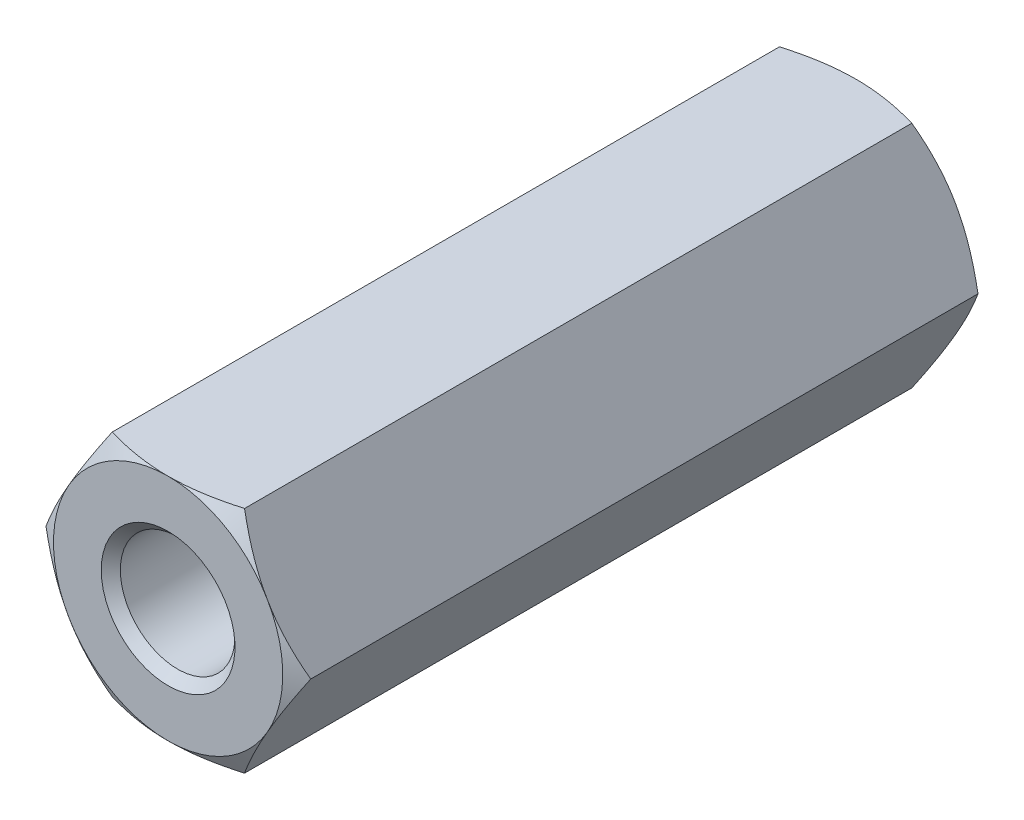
ISO-10303-21;
HEADER;
FILE_DESCRIPTION(('STEP AP214'),'2;1');
FILE_NAME('part.step','',(''),(''),'','','');
FILE_SCHEMA(('AUTOMOTIVE_DESIGN { 1 0 10303 214 1 1 1 1 }'));
ENDSEC;
DATA;
#1=APPLICATION_CONTEXT('core data for automotive mechanical design processes');
#2=APPLICATION_PROTOCOL_DEFINITION('international standard','automotive_design',2000,#1);
#3=PRODUCT_CONTEXT('',#1,'mechanical');
#4=PRODUCT('Part','Part','',(#3));
#5=PRODUCT_RELATED_PRODUCT_CATEGORY('part','',(#4));
#6=PRODUCT_DEFINITION_FORMATION('','',#4);
#7=PRODUCT_DEFINITION_CONTEXT('part definition',#1,'design');
#8=PRODUCT_DEFINITION('design','',#6,#7);
#9=PRODUCT_DEFINITION_SHAPE('','',#8);
#10=(LENGTH_UNIT() NAMED_UNIT(*) SI_UNIT(.MILLI.,.METRE.));
#11=(NAMED_UNIT(*) PLANE_ANGLE_UNIT() SI_UNIT($,.RADIAN.));
#12=(NAMED_UNIT(*) SI_UNIT($,.STERADIAN.) SOLID_ANGLE_UNIT());
#13=UNCERTAINTY_MEASURE_WITH_UNIT(LENGTH_MEASURE(1.E-05),#10,'distance_accuracy_value','');
#14=(GEOMETRIC_REPRESENTATION_CONTEXT(3) GLOBAL_UNCERTAINTY_ASSIGNED_CONTEXT((#13)) GLOBAL_UNIT_ASSIGNED_CONTEXT((#10,
#11,#12)) REPRESENTATION_CONTEXT('',''));
#15=CARTESIAN_POINT('',(0.,0.,0.));
#16=DIRECTION('',(0.,0.,1.));
#17=DIRECTION('',(1.,0.,0.));
#18=AXIS2_PLACEMENT_3D('',#15,#16,#17);
#19=CARTESIAN_POINT('',(3.46410161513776,0.,-9.));
#20=DIRECTION('',(0.866025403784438,0.5,0.));
#21=DIRECTION('',(-0.5,0.866025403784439,0.));
#22=AXIS2_PLACEMENT_3D('',#19,#20,#21);
#23=PLANE('',#22);
#24=CARTESIAN_POINT('',(3.46421708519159,-0.000199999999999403,8.73198413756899));
#25=CARTESIAN_POINT('',(3.38810199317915,0.131635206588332,8.77594629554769));
#26=CARTESIAN_POINT('',(3.31132988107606,0.26460840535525,8.81592841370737));
#27=CARTESIAN_POINT('',(3.15645624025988,0.532857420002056,8.88571791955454));
#28=CARTESIAN_POINT('',(3.078351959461,0.668138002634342,8.91550061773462));
#29=CARTESIAN_POINT('',(2.92311136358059,0.937022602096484,8.96186216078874));
#30=CARTESIAN_POINT('',(2.84599893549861,1.07058524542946,8.97874955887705));
#31=CARTESIAN_POINT('',(2.6914112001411,1.33833905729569,8.99891035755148));
#32=CARTESIAN_POINT('',(2.61393645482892,1.47252925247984,9.00220045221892));
#33=CARTESIAN_POINT('',(2.46916798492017,1.72327559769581,8.99535946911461));
#34=CARTESIAN_POINT('',(2.40185259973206,1.83986926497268,8.98690808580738));
#35=CARTESIAN_POINT('',(2.2676603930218,2.07229698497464,8.96012105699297));
#36=CARTESIAN_POINT('',(2.2007840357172,2.18813023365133,8.94177625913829));
#37=CARTESIAN_POINT('',(2.06631510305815,2.42103725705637,8.89591524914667));
#38=CARTESIAN_POINT('',(1.99873954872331,2.53808155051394,8.86820461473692));
#39=CARTESIAN_POINT('',(1.86459637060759,2.77042435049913,8.8053122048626));
#40=CARTESIAN_POINT('',(1.79802702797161,2.88572583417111,8.77014520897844));
#41=CARTESIAN_POINT('',(1.73193533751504,3.0002,8.73198413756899));
#42=B_SPLINE_CURVE_WITH_KNOTS('',3,(#24,#25,#26,#27,#28,#29,#30,#31,#32,#33,#34,#35,#36,#37,#38,
#39,#40,#41),.UNSPECIFIED.,.F.,.F.,(4,2,2,2,2,2,2,2,4),(0.,0.475539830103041,0.952222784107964,
1.41710776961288,1.88142182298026,2.28572436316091,2.69040156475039,3.10405572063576,
3.51689749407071),.UNSPECIFIED.);
#43=CARTESIAN_POINT('',(3.46410161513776,0.,8.73205080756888));
#44=VERTEX_POINT('',#43);
#45=CARTESIAN_POINT('',(2.59807621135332,1.5,9.));
#46=VERTEX_POINT('',#45);
#47=EDGE_CURVE('E127',#44,#46,#42,.T.);
#48=ORIENTED_EDGE('',*,*,#47,.F.);
#49=DIRECTION('',(0.,0.,1.));
#50=VECTOR('',#49,1.);
#51=CARTESIAN_POINT('',(3.46410161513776,0.,-9.));
#52=LINE('',#51,#50);
#53=CARTESIAN_POINT('',(3.46410161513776,0.,-8.73205080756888));
#54=VERTEX_POINT('',#53);
#55=EDGE_CURVE('E594',#54,#44,#52,.T.);
#56=ORIENTED_EDGE('',*,*,#55,.F.);
#57=CARTESIAN_POINT('',(3.46421708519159,-0.000199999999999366,-8.73198413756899));
#58=CARTESIAN_POINT('',(3.38810199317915,0.131635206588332,-8.77594629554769));
#59=CARTESIAN_POINT('',(3.31132988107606,0.26460840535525,-8.81592841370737));
#60=CARTESIAN_POINT('',(3.15645624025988,0.532857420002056,-8.88571791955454));
#61=CARTESIAN_POINT('',(3.078351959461,0.668138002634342,-8.91550061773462));
#62=CARTESIAN_POINT('',(2.92311136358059,0.937022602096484,-8.96186216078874));
#63=CARTESIAN_POINT('',(2.84599893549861,1.07058524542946,-8.97874955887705));
#64=CARTESIAN_POINT('',(2.6914112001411,1.33833905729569,-8.99891035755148));
#65=CARTESIAN_POINT('',(2.61393645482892,1.47252925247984,-9.00220045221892));
#66=CARTESIAN_POINT('',(2.46916798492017,1.72327559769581,-8.99535946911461));
#67=CARTESIAN_POINT('',(2.40185259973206,1.83986926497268,-8.98690808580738));
#68=CARTESIAN_POINT('',(2.2676603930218,2.07229698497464,-8.96012105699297));
#69=CARTESIAN_POINT('',(2.2007840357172,2.18813023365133,-8.94177625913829));
#70=CARTESIAN_POINT('',(2.06631510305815,2.42103725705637,-8.89591524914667));
#71=CARTESIAN_POINT('',(1.99873954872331,2.53808155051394,-8.86820461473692));
#72=CARTESIAN_POINT('',(1.86459637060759,2.77042435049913,-8.8053122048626));
#73=CARTESIAN_POINT('',(1.79802702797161,2.88572583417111,-8.77014520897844));
#74=CARTESIAN_POINT('',(1.73193533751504,3.0002,-8.73198413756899));
#75=B_SPLINE_CURVE_WITH_KNOTS('',3,(#57,#58,#59,#60,#61,#62,#63,#64,#65,#66,#67,#68,#69,#70,#71,
#72,#73,#74),.UNSPECIFIED.,.F.,.F.,(4,2,2,2,2,2,2,2,4),(0.,0.475539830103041,0.952222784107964,
1.41710776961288,1.88142182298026,2.28572436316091,2.69040156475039,3.10405572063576,
3.51689749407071),.UNSPECIFIED.);
#76=CARTESIAN_POINT('',(2.59807621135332,1.5,-9.));
#77=VERTEX_POINT('',#76);
#78=EDGE_CURVE('E590',#54,#77,#75,.T.);
#79=ORIENTED_EDGE('',*,*,#78,.T.);
#80=CARTESIAN_POINT('',(1.73205080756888,3.,-8.73205080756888));
#81=VERTEX_POINT('',#80);
#82=EDGE_CURVE('E268',#77,#81,#75,.T.);
#83=ORIENTED_EDGE('',*,*,#82,.T.);
#84=DIRECTION('',(0.,0.,1.));
#85=VECTOR('',#84,1.);
#86=CARTESIAN_POINT('',(1.73205080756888,3.,-9.));
#87=LINE('',#86,#85);
#88=CARTESIAN_POINT('',(1.73205080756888,3.,8.73205080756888));
#89=VERTEX_POINT('',#88);
#90=EDGE_CURVE('E159',#81,#89,#87,.T.);
#91=ORIENTED_EDGE('',*,*,#90,.T.);
#92=EDGE_CURVE('E140',#46,#89,#42,.T.);
#93=ORIENTED_EDGE('',*,*,#92,.F.);
#94=EDGE_LOOP('',(#48,#56,#79,#83,#91,#93));
#95=FACE_BOUND('',#94,.T.);
#96=ADVANCED_FACE('F41',(#95),#23,.T.);
#97=CARTESIAN_POINT('',(1.73205080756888,-3.,-9.));
#98=DIRECTION('',(0.866025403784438,-0.5,0.));
#99=DIRECTION('',(0.5,0.866025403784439,0.));
#100=AXIS2_PLACEMENT_3D('',#97,#98,#99);
#101=PLANE('',#100);
#102=CARTESIAN_POINT('',(1.73193533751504,-3.0002,8.73198413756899));
#103=CARTESIAN_POINT('',(1.80805042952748,-2.86836479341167,8.77594629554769));
#104=CARTESIAN_POINT('',(1.88482254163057,-2.73539159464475,8.81592841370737));
#105=CARTESIAN_POINT('',(2.03969618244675,-2.46714257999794,8.88571791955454));
#106=CARTESIAN_POINT('',(2.11780046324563,-2.33186199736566,8.91550061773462));
#107=CARTESIAN_POINT('',(2.27304105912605,-2.06297739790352,8.96186216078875));
#108=CARTESIAN_POINT('',(2.35015348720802,-1.92941475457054,8.97874955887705));
#109=CARTESIAN_POINT('',(2.50474122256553,-1.66166094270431,8.99891035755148));
#110=CARTESIAN_POINT('',(2.58221596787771,-1.52747074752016,9.00220045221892));
#111=CARTESIAN_POINT('',(2.72698443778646,-1.27672440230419,8.99535946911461));
#112=CARTESIAN_POINT('',(2.79429982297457,-1.16013073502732,8.98690808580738));
#113=CARTESIAN_POINT('',(2.92849202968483,-0.927703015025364,8.96012105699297));
#114=CARTESIAN_POINT('',(2.99536838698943,-0.811869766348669,8.94177625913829));
#115=CARTESIAN_POINT('',(3.12983731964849,-0.578962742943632,8.89591524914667));
#116=CARTESIAN_POINT('',(3.19741287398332,-0.461918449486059,8.86820461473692));
#117=CARTESIAN_POINT('',(3.33155605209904,-0.229575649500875,8.8053122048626));
#118=CARTESIAN_POINT('',(3.39812539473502,-0.114274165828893,8.77014520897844));
#119=CARTESIAN_POINT('',(3.46421708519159,0.000200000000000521,8.73198413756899));
#120=B_SPLINE_CURVE_WITH_KNOTS('',3,(#102,#103,#104,#105,#106,#107,#108,#109,#110,#111,#112,
#113,#114,#115,#116,#117,#118,#119),.UNSPECIFIED.,.F.,.F.,(4,2,2,2,2,2,2,2,4),(0.,
0.47553983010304,0.952222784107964,1.41710776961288,1.88142182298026,2.28572436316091,
2.69040156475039,3.10405572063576,3.5168974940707),.UNSPECIFIED.);
#121=CARTESIAN_POINT('',(1.73205080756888,-3.,8.73205080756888));
#122=VERTEX_POINT('',#121);
#123=CARTESIAN_POINT('',(2.59807621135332,-1.5,9.));
#124=VERTEX_POINT('',#123);
#125=EDGE_CURVE('E530',#122,#124,#120,.T.);
#126=ORIENTED_EDGE('',*,*,#125,.F.);
#127=DIRECTION('',(0.,0.,1.));
#128=VECTOR('',#127,1.);
#129=CARTESIAN_POINT('',(1.73205080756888,-3.,-9.));
#130=LINE('',#129,#128);
#131=CARTESIAN_POINT('',(1.73205080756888,-3.,-8.73205080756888));
#132=VERTEX_POINT('',#131);
#133=EDGE_CURVE('E282',#132,#122,#130,.T.);
#134=ORIENTED_EDGE('',*,*,#133,.F.);
#135=CARTESIAN_POINT('',(1.73193533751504,-3.0002,-8.73198413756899));
#136=CARTESIAN_POINT('',(1.80805042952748,-2.86836479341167,-8.77594629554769));
#137=CARTESIAN_POINT('',(1.88482254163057,-2.73539159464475,-8.81592841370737));
#138=CARTESIAN_POINT('',(2.03969618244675,-2.46714257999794,-8.88571791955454));
#139=CARTESIAN_POINT('',(2.11780046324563,-2.33186199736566,-8.91550061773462));
#140=CARTESIAN_POINT('',(2.27304105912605,-2.06297739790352,-8.96186216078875));
#141=CARTESIAN_POINT('',(2.35015348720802,-1.92941475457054,-8.97874955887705));
#142=CARTESIAN_POINT('',(2.50474122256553,-1.66166094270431,-8.99891035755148));
#143=CARTESIAN_POINT('',(2.58221596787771,-1.52747074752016,-9.00220045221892));
#144=CARTESIAN_POINT('',(2.72698443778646,-1.27672440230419,-8.99535946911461));
#145=CARTESIAN_POINT('',(2.79429982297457,-1.16013073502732,-8.98690808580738));
#146=CARTESIAN_POINT('',(2.92849202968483,-0.927703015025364,-8.96012105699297));
#147=CARTESIAN_POINT('',(2.99536838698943,-0.811869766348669,-8.94177625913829));
#148=CARTESIAN_POINT('',(3.12983731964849,-0.578962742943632,-8.89591524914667));
#149=CARTESIAN_POINT('',(3.19741287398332,-0.461918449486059,-8.86820461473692));
#150=CARTESIAN_POINT('',(3.33155605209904,-0.229575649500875,-8.8053122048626));
#151=CARTESIAN_POINT('',(3.39812539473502,-0.114274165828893,-8.77014520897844));
#152=CARTESIAN_POINT('',(3.46421708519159,0.000200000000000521,-8.73198413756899));
#153=B_SPLINE_CURVE_WITH_KNOTS('',3,(#135,#136,#137,#138,#139,#140,#141,#142,#143,#144,#145,
#146,#147,#148,#149,#150,#151,#152),.UNSPECIFIED.,.F.,.F.,(4,2,2,2,2,2,2,2,4),(0.,
0.47553983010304,0.952222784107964,1.41710776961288,1.88142182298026,2.28572436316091,
2.69040156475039,3.10405572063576,3.5168974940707),.UNSPECIFIED.);
#154=CARTESIAN_POINT('',(2.59807621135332,-1.5,-9.));
#155=VERTEX_POINT('',#154);
#156=EDGE_CURVE('E586',#132,#155,#153,.T.);
#157=ORIENTED_EDGE('',*,*,#156,.T.);
#158=EDGE_CURVE('E283',#155,#54,#153,.T.);
#159=ORIENTED_EDGE('',*,*,#158,.T.);
#160=ORIENTED_EDGE('',*,*,#55,.T.);
#161=EDGE_CURVE('E132',#124,#44,#120,.T.);
#162=ORIENTED_EDGE('',*,*,#161,.F.);
#163=EDGE_LOOP('',(#126,#134,#157,#159,#160,#162));
#164=FACE_BOUND('',#163,.T.);
#165=ADVANCED_FACE('F253',(#164),#101,.T.);
#166=CARTESIAN_POINT('',(-1.73205080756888,-3.,-9.));
#167=DIRECTION('',(0.,-1.,0.));
#168=DIRECTION('',(0.,0.,-1.));
#169=AXIS2_PLACEMENT_3D('',#166,#167,#168);
#170=PLANE('',#169);
#171=CARTESIAN_POINT('',(-15.3594783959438,-3.,1.69668369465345));
#172=CARTESIAN_POINT('',(-15.0272376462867,-3.,1.88494028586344));
#173=CARTESIAN_POINT('',(-14.6949048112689,-3.,2.07303463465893));
#174=CARTESIAN_POINT('',(-14.0300037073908,-3.,2.44880847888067));
#175=CARTESIAN_POINT('',(-13.6974354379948,-3.,2.63648797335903));
#176=CARTESIAN_POINT('',(-13.0319689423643,-3.,3.01136610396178));
#177=CARTESIAN_POINT('',(-12.6990706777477,-3.,3.19856467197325));
#178=CARTESIAN_POINT('',(-12.0329181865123,-3.,3.57232679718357));
#179=CARTESIAN_POINT('',(-11.6996639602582,-3.,3.75889035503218));
#180=CARTESIAN_POINT('',(-11.0351927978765,-3.,4.1298203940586));
#181=CARTESIAN_POINT('',(-10.7039792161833,-3.,4.31419288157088));
#182=CARTESIAN_POINT('',(-10.0409795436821,-3.,4.68190549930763));
#183=CARTESIAN_POINT('',(-9.70919345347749,-3.,4.86524563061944));
#184=CARTESIAN_POINT('',(-9.04489381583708,-3.,5.23054052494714));
#185=CARTESIAN_POINT('',(-8.71238032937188,-3.,5.41249539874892));
#186=CARTESIAN_POINT('',(-8.04633727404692,-3.,5.77453439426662));
#187=CARTESIAN_POINT('',(-7.71280771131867,-3.,5.9546185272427));
#188=CARTESIAN_POINT('',(-7.03854276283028,-3.,6.31523968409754));
#189=CARTESIAN_POINT('',(-6.69778263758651,-3.,6.4957305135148));
#190=CARTESIAN_POINT('',(-6.01409586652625,-3.,6.85271021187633));
#191=CARTESIAN_POINT('',(-5.67116891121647,-3.,7.02919849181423));
#192=CARTESIAN_POINT('',(-5.15326824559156,-3.,7.28971433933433));
#193=CARTESIAN_POINT('',(-4.97949126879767,-3.,7.3761182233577));
#194=CARTESIAN_POINT('',(-4.63091446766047,-3.,7.54683419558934));
#195=CARTESIAN_POINT('',(-4.4561146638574,-3.,7.6311463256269));
#196=CARTESIAN_POINT('',(-4.10525906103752,-3.,7.79703171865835));
#197=CARTESIAN_POINT('',(-3.92920352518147,-3.,7.87860553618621));
#198=CARTESIAN_POINT('',(-3.57546164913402,-3.,8.03812434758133));
#199=CARTESIAN_POINT('',(-3.39777541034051,-3.,8.11606956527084));
#200=CARTESIAN_POINT('',(-3.02466651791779,-3.,8.27366381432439));
#201=CARTESIAN_POINT('',(-2.82905283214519,-3.,8.35286472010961));
#202=CARTESIAN_POINT('',(-2.43459567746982,-3.,8.50305592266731));
#203=CARTESIAN_POINT('',(-2.2357514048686,-3.,8.57404413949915));
#204=CARTESIAN_POINT('',(-1.8362269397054,-3.,8.70353127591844));
#205=CARTESIAN_POINT('',(-1.63558689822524,-3.,8.76215157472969));
#206=CARTESIAN_POINT('',(-1.23018991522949,-3.,8.86299720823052));
#207=CARTESIAN_POINT('',(-1.02543549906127,-3.,8.90523229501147));
#208=CARTESIAN_POINT('',(-0.653154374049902,-3.,8.96182853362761));
#209=CARTESIAN_POINT('',(-0.486226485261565,-3.,8.9800382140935));
#210=CARTESIAN_POINT('',(-0.151418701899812,-3.,9.00045457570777));
#211=CARTESIAN_POINT('',(0.016460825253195,-3.,9.00266706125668));
#212=CARTESIAN_POINT('',(0.352541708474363,-3.,8.99078802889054));
#213=CARTESIAN_POINT('',(0.520739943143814,-3.,8.97660880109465));
#214=CARTESIAN_POINT('',(0.771542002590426,-3.,8.94426108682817));
#215=CARTESIAN_POINT('',(0.854911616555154,-3.,8.93162804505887));
#216=CARTESIAN_POINT('',(1.02106646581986,-3.,8.90299731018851));
#217=CARTESIAN_POINT('',(1.10385173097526,-3.,8.8869997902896));
#218=CARTESIAN_POINT('',(1.44502513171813,-3.,8.81457729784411));
#219=CARTESIAN_POINT('',(1.70062255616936,-3.,8.74481471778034));
#220=CARTESIAN_POINT('',(2.07927734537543,-3.,8.62553500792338));
#221=CARTESIAN_POINT('',(2.20481022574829,-3.,8.58329358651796));
#222=CARTESIAN_POINT('',(2.45449071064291,-3.,8.49488033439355));
#223=CARTESIAN_POINT('',(2.57863844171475,-3.,8.4487088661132));
#224=CARTESIAN_POINT('',(2.8262804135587,-3.,8.3530204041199));
#225=CARTESIAN_POINT('',(2.94976901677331,-3.,8.30348899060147));
#226=CARTESIAN_POINT('',(3.19570120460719,-3.,8.20188952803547));
#227=CARTESIAN_POINT('',(3.31814474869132,-3.,8.1498213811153));
#228=CARTESIAN_POINT('',(3.68398065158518,-3.,7.99064735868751));
#229=CARTESIAN_POINT('',(3.92604915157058,-3.,7.8805042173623));
#230=CARTESIAN_POINT('',(4.41282935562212,-3.,7.65241171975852));
#231=CARTESIAN_POINT('',(4.6574855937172,-3.,7.53434528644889));
#232=CARTESIAN_POINT('',(5.14491443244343,-3.,7.29431998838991));
#233=CARTESIAN_POINT('',(5.38768678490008,-3.,7.17236062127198));
#234=CARTESIAN_POINT('',(5.87112188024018,-3.,6.92603730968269));
#235=CARTESIAN_POINT('',(6.11178868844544,-3.,6.80168131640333));
#236=CARTESIAN_POINT('',(6.5920679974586,-3.,6.55094746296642));
#237=CARTESIAN_POINT('',(6.83168048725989,-3.,6.4245695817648));
#238=CARTESIAN_POINT('',(7.42793091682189,-3.,6.10767250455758));
#239=CARTESIAN_POINT('',(7.78407379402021,-3.,5.91622282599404));
#240=CARTESIAN_POINT('',(8.49511889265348,-3.,5.53102441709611));
#241=CARTESIAN_POINT('',(8.85002109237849,-3.,5.33727564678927));
#242=CARTESIAN_POINT('',(9.55929235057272,-3.,4.94793482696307));
#243=CARTESIAN_POINT('',(9.91366047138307,-3.,4.75234107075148));
#244=CARTESIAN_POINT('',(10.6217262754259,-3.,4.35994409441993));
#245=CARTESIAN_POINT('',(10.9754239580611,-3.,4.16314087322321));
#246=CARTESIAN_POINT('',(11.6656323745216,-3.,3.77792591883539));
#247=CARTESIAN_POINT('',(12.0021666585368,-3.,3.58955635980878));
#248=CARTESIAN_POINT('',(12.6748702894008,-3.,3.21216536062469));
#249=CARTESIAN_POINT('',(13.0110396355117,-3.,3.02314391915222));
#250=CARTESIAN_POINT('',(13.6827227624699,-3.,2.64478779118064));
#251=CARTESIAN_POINT('',(14.0182368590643,-3.,2.45545366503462));
#252=CARTESIAN_POINT('',(14.6890246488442,-3.,2.07636258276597));
#253=CARTESIAN_POINT('',(15.0242983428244,-3.,1.88660562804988));
#254=CARTESIAN_POINT('',(15.3594783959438,-3.,1.69668369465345));
#255=B_SPLINE_CURVE_WITH_KNOTS('',3,(#171,#172,#173,#174,#175,#176,#177,#178,#179,#180,#181,
#182,#183,#184,#185,#186,#187,#188,#189,#190,#191,#192,#193,#194,#195,#196,#197,#198,#199,#200,
#201,#202,#203,#204,#205,#206,#207,#208,#209,#210,#211,#212,#213,#214,#215,#216,#217,#218,#219,
#220,#221,#222,#223,#224,#225,#226,#227,#228,#229,#230,#231,#232,#233,#234,#235,#236,#237,#238,
#239,#240,#241,#242,#243,#244,#245,#246,#247,#248,#249,#250,#251,#252,#253,#254),.UNSPECIFIED.,
.F.,.F.,(4,2,2,2,2,2,2,2,2,2,2,2,2,2,2,2,2,2,2,2,2,2,2,2,2,2,2,2,2,2,2,2,2,2,2,2,2,2,2,2,2,4),
(0.,1.14560922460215,2.29122106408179,3.43698707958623,4.58275192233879,5.71996682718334,
6.85718053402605,7.99430231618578,9.13141724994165,10.2882302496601,11.4452123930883,
12.027419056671,12.6096140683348,13.1916904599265,13.7737308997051,14.4067213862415,
15.0398718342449,15.6664852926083,16.2927252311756,16.7957927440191,17.2986777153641,
17.8042660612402,18.0571713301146,18.3100635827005,19.1033764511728,19.500709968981,
19.8980068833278,20.2971323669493,20.6962732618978,21.4940040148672,22.3089268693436,
23.1239553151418,23.9366326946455,24.7493185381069,25.9623244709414,27.1753515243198,
28.3896394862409,29.6039285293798,30.7609262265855,31.9179262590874,33.0736742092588,
34.2294183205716),.UNSPECIFIED.);
#256=CARTESIAN_POINT('',(-1.73205080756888,-3.,8.73205080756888));
#257=VERTEX_POINT('',#256);
#258=CARTESIAN_POINT('',(0.,-3.,9.));
#259=VERTEX_POINT('',#258);
#260=EDGE_CURVE('E531',#257,#259,#255,.T.);
#261=ORIENTED_EDGE('',*,*,#260,.F.);
#262=DIRECTION('',(0.,0.,1.));
#263=VECTOR('',#262,1.);
#264=CARTESIAN_POINT('',(-1.73205080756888,-3.,-9.));
#265=LINE('',#264,#263);
#266=CARTESIAN_POINT('',(-1.73205080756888,-3.,-8.73205080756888));
#267=VERTEX_POINT('',#266);
#268=EDGE_CURVE('E529',#267,#257,#265,.T.);
#269=ORIENTED_EDGE('',*,*,#268,.F.);
#270=CARTESIAN_POINT('',(-9.48037066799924,-3.,-4.99104543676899));
#271=CARTESIAN_POINT('',(-9.27076981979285,-3.,-5.10641213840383));
#272=CARTESIAN_POINT('',(-9.06102757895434,-3.,-5.22152299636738));
#273=CARTESIAN_POINT('',(-8.6411847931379,-3.,-5.45109551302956));
#274=CARTESIAN_POINT('',(-8.43108424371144,-3.,-5.5655571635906));
#275=CARTESIAN_POINT('',(-8.01034504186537,-3.,-5.79375025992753));
#276=CARTESIAN_POINT('',(-7.79970616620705,-3.,-5.90748129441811));
#277=CARTESIAN_POINT('',(-7.37790002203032,-3.,-6.13395739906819));
#278=CARTESIAN_POINT('',(-7.1667327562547,-3.,-6.24670247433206));
#279=CARTESIAN_POINT('',(-6.73975920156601,-3.,-6.473057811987));
#280=CARTESIAN_POINT('',(-6.5239403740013,-3.,-6.58664445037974));
#281=CARTESIAN_POINT('',(-6.09143245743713,-3.,-6.81214808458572));
#282=CARTESIAN_POINT('',(-5.87474337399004,-3.,-6.92406509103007));
#283=CARTESIAN_POINT('',(-5.44028854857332,-3.,-7.14567048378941));
#284=CARTESIAN_POINT('',(-5.22252306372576,-3.,-7.25535937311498));
#285=CARTESIAN_POINT('',(-4.78551896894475,-3.,-7.47175712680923));
#286=CARTESIAN_POINT('',(-4.56628040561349,-3.,-7.57846608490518));
#287=CARTESIAN_POINT('',(-4.12141829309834,-3.,-7.7898418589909));
#288=CARTESIAN_POINT('',(-3.895754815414,-3.,-7.89442494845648));
#289=CARTESIAN_POINT('',(-3.44156769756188,-3.,-8.09743454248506));
#290=CARTESIAN_POINT('',(-3.21304334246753,-3.,-8.19585946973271));
#291=CARTESIAN_POINT('',(-2.8677709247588,-3.,-8.33639185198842));
#292=CARTESIAN_POINT('',(-2.7524446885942,-3.,-8.38198725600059));
#293=CARTESIAN_POINT('',(-2.52070427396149,-3.,-8.47031427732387));
#294=CARTESIAN_POINT('',(-2.40429017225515,-3.,-8.51304609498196));
#295=CARTESIAN_POINT('',(-2.17024404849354,-3.,-8.59497305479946));
#296=CARTESIAN_POINT('',(-2.05261230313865,-3.,-8.63416898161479));
#297=CARTESIAN_POINT('',(-1.8159913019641,-3.,-8.70819781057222));
#298=CARTESIAN_POINT('',(-1.69700219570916,-3.,-8.74303118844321));
#299=CARTESIAN_POINT('',(-1.41292707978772,-3.,-8.81935745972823));
#300=CARTESIAN_POINT('',(-1.24719250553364,-3.,-8.85849221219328));
#301=CARTESIAN_POINT('',(-0.913152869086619,-3.,-8.92380314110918));
#302=CARTESIAN_POINT('',(-0.744848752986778,-3.,-8.94998397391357));
#303=CARTESIAN_POINT('',(-0.491674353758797,-3.,-8.97754290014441));
#304=CARTESIAN_POINT('',(-0.407421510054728,-3.,-8.9847727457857));
#305=CARTESIAN_POINT('',(-0.238661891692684,-3.,-8.99520182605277));
#306=CARTESIAN_POINT('',(-0.154155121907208,-3.,-8.99840113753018));
#307=CARTESIAN_POINT('',(0.0149100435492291,-3.,-9.000666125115));
#308=CARTESIAN_POINT('',(0.0994684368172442,-3.,-8.99973198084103));
#309=CARTESIAN_POINT('',(0.26844155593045,-3.,-8.99376172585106));
#310=CARTESIAN_POINT('',(0.352856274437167,-3.,-8.98872541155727));
#311=CARTESIAN_POINT('',(0.543565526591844,-3.,-8.97284889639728));
#312=CARTESIAN_POINT('',(0.649762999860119,-3.,-8.9608288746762));
#313=CARTESIAN_POINT('',(0.861332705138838,-3.,-8.93099941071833));
#314=CARTESIAN_POINT('',(0.966704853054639,-3.,-8.91318938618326));
#315=CARTESIAN_POINT('',(1.28150190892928,-3.,-8.85205502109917));
#316=CARTESIAN_POINT('',(1.48945094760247,-3.,-8.80104122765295));
#317=CARTESIAN_POINT('',(1.80025015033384,-3.,-8.71276654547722));
#318=CARTESIAN_POINT('',(1.90475297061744,-3.,-8.68098473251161));
#319=CARTESIAN_POINT('',(2.11266195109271,-3.,-8.61419925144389));
#320=CARTESIAN_POINT('',(2.21606875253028,-3.,-8.57919759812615));
#321=CARTESIAN_POINT('',(2.42191065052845,-3.,-8.50651569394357));
#322=CARTESIAN_POINT('',(2.52434588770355,-3.,-8.46883583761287));
#323=CARTESIAN_POINT('',(2.72838316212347,-3.,-8.3912399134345));
#324=CARTESIAN_POINT('',(2.82998505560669,-3.,-8.3513234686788));
#325=CARTESIAN_POINT('',(3.0797954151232,-3.,-8.25053093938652));
#326=CARTESIAN_POINT('',(3.2275716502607,-3.,-8.18858530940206));
#327=CARTESIAN_POINT('',(3.52180299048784,-3.,-8.06162274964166));
#328=CARTESIAN_POINT('',(3.66825799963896,-3.,-7.99660559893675));
#329=CARTESIAN_POINT('',(3.96010375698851,-3.,-7.86416655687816));
#330=CARTESIAN_POINT('',(4.10549431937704,-3.,-7.79674425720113));
#331=CARTESIAN_POINT('',(4.39538240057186,-3.,-7.66000339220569));
#332=CARTESIAN_POINT('',(4.53987989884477,-3.,-7.59068478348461));
#333=CARTESIAN_POINT('',(4.97261919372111,-3.,-7.38030735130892));
#334=CARTESIAN_POINT('',(5.25976053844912,-3.,-7.2369868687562));
#335=CARTESIAN_POINT('',(5.83197829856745,-3.,-6.94639430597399));
#336=CARTESIAN_POINT('',(6.11705496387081,-3.,-6.7991227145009));
#337=CARTESIAN_POINT('',(6.66005071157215,-3.,-6.51524874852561));
#338=CARTESIAN_POINT('',(6.91809501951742,-3.,-6.37888548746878));
#339=CARTESIAN_POINT('',(7.43328689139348,-3.,-6.10445590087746));
#340=CARTESIAN_POINT('',(7.69043442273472,-3.,-5.96638951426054));
#341=CARTESIAN_POINT('',(8.2033611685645,-3.,-5.68933577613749));
#342=CARTESIAN_POINT('',(8.45914220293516,-3.,-5.55035178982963));
#343=CARTESIAN_POINT('',(8.97014051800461,-3.,-5.27138329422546));
#344=CARTESIAN_POINT('',(9.22535782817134,-3.,-5.13139883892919));
#345=CARTESIAN_POINT('',(9.48037066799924,-3.,-4.99104543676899));
#346=B_SPLINE_CURVE_WITH_KNOTS('',3,(#270,#271,#272,#273,#274,#275,#276,#277,#278,#279,#280,
#281,#282,#283,#284,#285,#286,#287,#288,#289,#290,#291,#292,#293,#294,#295,#296,#297,#298,#299,
#300,#301,#302,#303,#304,#305,#306,#307,#308,#309,#310,#311,#312,#313,#314,#315,#316,#317,#318,
#319,#320,#321,#322,#323,#324,#325,#326,#327,#328,#329,#330,#331,#332,#333,#334,#335,#336,#337,
#338,#339,#340,#341,#342,#343,#344,#345),.UNSPECIFIED.,.F.,.F.,(4,2,2,2,2,2,2,2,2,2,2,2,2,2,2,2,
2,2,2,2,2,2,2,2,2,2,2,2,2,2,2,2,2,2,2,2,2,4),(0.,0.717759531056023,1.4355280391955,
2.15367031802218,2.87180887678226,3.60345714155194,4.33510074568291,5.06657729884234,
5.79803081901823,6.544136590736,7.29043268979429,7.66244065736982,8.03442257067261,
8.40632173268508,8.77818030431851,9.28866141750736,9.79895890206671,10.0525636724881,
10.3061636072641,10.5597525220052,10.8133540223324,11.1337939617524,11.4542661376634,
12.0956798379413,12.4233397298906,12.7507959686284,13.0782040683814,13.4056675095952,
13.8863220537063,14.3670112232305,14.8477823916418,15.3285645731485,16.2912756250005,
17.2538681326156,18.1294372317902,19.0050378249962,19.8783419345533,20.7515992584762),.UNSPECIFIED.);
#347=CARTESIAN_POINT('',(0.,-3.,-9.));
#348=VERTEX_POINT('',#347);
#349=EDGE_CURVE('E599',#267,#348,#346,.T.);
#350=ORIENTED_EDGE('',*,*,#349,.T.);
#351=EDGE_CURVE('E258',#348,#132,#346,.T.);
#352=ORIENTED_EDGE('',*,*,#351,.T.);
#353=ORIENTED_EDGE('',*,*,#133,.T.);
#354=EDGE_CURVE('E138',#259,#122,#255,.T.);
#355=ORIENTED_EDGE('',*,*,#354,.F.);
#356=EDGE_LOOP('',(#261,#269,#350,#352,#353,#355));
#357=FACE_BOUND('',#356,.T.);
#358=ADVANCED_FACE('F291',(#357),#170,.T.);
#359=CARTESIAN_POINT('',(-3.46410161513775,0.,-9.));
#360=DIRECTION('',(-0.866025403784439,-0.5,0.));
#361=DIRECTION('',(0.5,-0.866025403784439,0.));
#362=AXIS2_PLACEMENT_3D('',#359,#360,#361);
#363=PLANE('',#362);
#364=CARTESIAN_POINT('',(-3.46421708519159,0.000200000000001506,8.73198413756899));
#365=CARTESIAN_POINT('',(-3.38810199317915,-0.131635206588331,8.77594629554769));
#366=CARTESIAN_POINT('',(-3.31132988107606,-0.264608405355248,8.81592841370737));
#367=CARTESIAN_POINT('',(-3.15645624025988,-0.532857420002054,8.88571791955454));
#368=CARTESIAN_POINT('',(-3.078351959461,-0.66813800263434,8.91550061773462));
#369=CARTESIAN_POINT('',(-2.92311136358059,-0.937022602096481,8.96186216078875));
#370=CARTESIAN_POINT('',(-2.84599893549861,-1.07058524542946,8.97874955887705));
#371=CARTESIAN_POINT('',(-2.6914112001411,-1.33833905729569,8.99891035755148));
#372=CARTESIAN_POINT('',(-2.61393645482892,-1.47252925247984,9.00220045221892));
#373=CARTESIAN_POINT('',(-2.46916798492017,-1.72327559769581,8.99535946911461));
#374=CARTESIAN_POINT('',(-2.40185259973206,-1.83986926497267,8.98690808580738));
#375=CARTESIAN_POINT('',(-2.2676603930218,-2.07229698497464,8.96012105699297));
#376=CARTESIAN_POINT('',(-2.2007840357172,-2.18813023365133,8.94177625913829));
#377=CARTESIAN_POINT('',(-2.06631510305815,-2.42103725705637,8.89591524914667));
#378=CARTESIAN_POINT('',(-1.99873954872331,-2.53808155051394,8.86820461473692));
#379=CARTESIAN_POINT('',(-1.86459637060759,-2.77042435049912,8.8053122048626));
#380=CARTESIAN_POINT('',(-1.79802702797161,-2.88572583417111,8.77014520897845));
#381=CARTESIAN_POINT('',(-1.73193533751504,-3.0002,8.73198413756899));
#382=B_SPLINE_CURVE_WITH_KNOTS('',3,(#364,#365,#366,#367,#368,#369,#370,#371,#372,#373,#374,
#375,#376,#377,#378,#379,#380,#381),.UNSPECIFIED.,.F.,.F.,(4,2,2,2,2,2,2,2,4),(0.,
0.475539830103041,0.952222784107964,1.41710776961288,1.88142182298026,2.28572436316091,
2.69040156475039,3.10405572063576,3.5168974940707),.UNSPECIFIED.);
#383=CARTESIAN_POINT('',(-3.46410161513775,0.,8.73205080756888));
#384=VERTEX_POINT('',#383);
#385=CARTESIAN_POINT('',(-2.59807621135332,-1.5,9.));
#386=VERTEX_POINT('',#385);
#387=EDGE_CURVE('E175',#384,#386,#382,.T.);
#388=ORIENTED_EDGE('',*,*,#387,.F.);
#389=DIRECTION('',(0.,0.,1.));
#390=VECTOR('',#389,1.);
#391=CARTESIAN_POINT('',(-3.46410161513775,0.,-9.));
#392=LINE('',#391,#390);
#393=CARTESIAN_POINT('',(-3.46410161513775,0.,-8.73205080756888));
#394=VERTEX_POINT('',#393);
#395=EDGE_CURVE('E584',#394,#384,#392,.T.);
#396=ORIENTED_EDGE('',*,*,#395,.F.);
#397=CARTESIAN_POINT('',(-3.46421708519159,0.000200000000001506,-8.73198413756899));
#398=CARTESIAN_POINT('',(-3.38810199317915,-0.131635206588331,-8.77594629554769));
#399=CARTESIAN_POINT('',(-3.31132988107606,-0.264608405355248,-8.81592841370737));
#400=CARTESIAN_POINT('',(-3.15645624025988,-0.532857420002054,-8.88571791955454));
#401=CARTESIAN_POINT('',(-3.078351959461,-0.66813800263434,-8.91550061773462));
#402=CARTESIAN_POINT('',(-2.92311136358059,-0.937022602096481,-8.96186216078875));
#403=CARTESIAN_POINT('',(-2.84599893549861,-1.07058524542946,-8.97874955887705));
#404=CARTESIAN_POINT('',(-2.6914112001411,-1.33833905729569,-8.99891035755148));
#405=CARTESIAN_POINT('',(-2.61393645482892,-1.47252925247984,-9.00220045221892));
#406=CARTESIAN_POINT('',(-2.46916798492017,-1.72327559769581,-8.99535946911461));
#407=CARTESIAN_POINT('',(-2.40185259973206,-1.83986926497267,-8.98690808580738));
#408=CARTESIAN_POINT('',(-2.2676603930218,-2.07229698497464,-8.96012105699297));
#409=CARTESIAN_POINT('',(-2.2007840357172,-2.18813023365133,-8.94177625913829));
#410=CARTESIAN_POINT('',(-2.06631510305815,-2.42103725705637,-8.89591524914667));
#411=CARTESIAN_POINT('',(-1.99873954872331,-2.53808155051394,-8.86820461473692));
#412=CARTESIAN_POINT('',(-1.86459637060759,-2.77042435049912,-8.8053122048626));
#413=CARTESIAN_POINT('',(-1.79802702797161,-2.88572583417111,-8.77014520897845));
#414=CARTESIAN_POINT('',(-1.73193533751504,-3.0002,-8.73198413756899));
#415=B_SPLINE_CURVE_WITH_KNOTS('',3,(#397,#398,#399,#400,#401,#402,#403,#404,#405,#406,#407,
#408,#409,#410,#411,#412,#413,#414),.UNSPECIFIED.,.F.,.F.,(4,2,2,2,2,2,2,2,4),(0.,
0.475539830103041,0.952222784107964,1.41710776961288,1.88142182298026,2.28572436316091,
2.69040156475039,3.10405572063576,3.5168974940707),.UNSPECIFIED.);
#416=CARTESIAN_POINT('',(-2.59807621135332,-1.5,-9.));
#417=VERTEX_POINT('',#416);
#418=EDGE_CURVE('E274',#394,#417,#415,.T.);
#419=ORIENTED_EDGE('',*,*,#418,.T.);
#420=EDGE_CURVE('E281',#417,#267,#415,.T.);
#421=ORIENTED_EDGE('',*,*,#420,.T.);
#422=ORIENTED_EDGE('',*,*,#268,.T.);
#423=EDGE_CURVE('E536',#386,#257,#382,.T.);
#424=ORIENTED_EDGE('',*,*,#423,.F.);
#425=EDGE_LOOP('',(#388,#396,#419,#421,#422,#424));
#426=FACE_BOUND('',#425,.T.);
#427=ADVANCED_FACE('F288',(#426),#363,.T.);
#428=CARTESIAN_POINT('',(-1.73205080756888,3.,-9.));
#429=DIRECTION('',(-0.866025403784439,0.5,0.));
#430=DIRECTION('',(-0.5,-0.866025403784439,0.));
#431=AXIS2_PLACEMENT_3D('',#428,#429,#430);
#432=PLANE('',#431);
#433=CARTESIAN_POINT('',(-1.73193533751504,3.0002,8.73198413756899));
#434=CARTESIAN_POINT('',(-1.80805042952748,2.86836479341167,8.77594629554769));
#435=CARTESIAN_POINT('',(-1.88482254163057,2.73539159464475,8.81592841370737));
#436=CARTESIAN_POINT('',(-2.03969618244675,2.46714257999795,8.88571791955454));
#437=CARTESIAN_POINT('',(-2.11780046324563,2.33186199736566,8.91550061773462));
#438=CARTESIAN_POINT('',(-2.27304105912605,2.06297739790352,8.96186216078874));
#439=CARTESIAN_POINT('',(-2.35015348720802,1.92941475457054,8.97874955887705));
#440=CARTESIAN_POINT('',(-2.50474122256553,1.66166094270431,8.99891035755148));
#441=CARTESIAN_POINT('',(-2.58221596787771,1.52747074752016,9.00220045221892));
#442=CARTESIAN_POINT('',(-2.72698443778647,1.27672440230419,8.99535946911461));
#443=CARTESIAN_POINT('',(-2.79429982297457,1.16013073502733,8.98690808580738));
#444=CARTESIAN_POINT('',(-2.92849202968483,0.927703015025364,8.96012105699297));
#445=CARTESIAN_POINT('',(-2.99536838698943,0.811869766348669,8.94177625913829));
#446=CARTESIAN_POINT('',(-3.12983731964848,0.578962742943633,8.89591524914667));
#447=CARTESIAN_POINT('',(-3.19741287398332,0.46191844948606,8.86820461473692));
#448=CARTESIAN_POINT('',(-3.33155605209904,0.229575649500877,8.8053122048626));
#449=CARTESIAN_POINT('',(-3.39812539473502,0.114274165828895,8.77014520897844));
#450=CARTESIAN_POINT('',(-3.46421708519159,-0.00019999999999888,8.73198413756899));
#451=B_SPLINE_CURVE_WITH_KNOTS('',3,(#433,#434,#435,#436,#437,#438,#439,#440,#441,#442,#443,
#444,#445,#446,#447,#448,#449,#450),.UNSPECIFIED.,.F.,.F.,(4,2,2,2,2,2,2,2,4),(0.,
0.475539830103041,0.952222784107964,1.41710776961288,1.88142182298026,2.28572436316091,
2.69040156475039,3.10405572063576,3.5168974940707),.UNSPECIFIED.);
#452=CARTESIAN_POINT('',(-1.73205080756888,3.,8.73205080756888));
#453=VERTEX_POINT('',#452);
#454=CARTESIAN_POINT('',(-2.59807621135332,1.5,9.));
#455=VERTEX_POINT('',#454);
#456=EDGE_CURVE('E182',#453,#455,#451,.T.);
#457=ORIENTED_EDGE('',*,*,#456,.F.);
#458=DIRECTION('',(0.,0.,1.));
#459=VECTOR('',#458,1.);
#460=CARTESIAN_POINT('',(-1.73205080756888,3.,-9.));
#461=LINE('',#460,#459);
#462=CARTESIAN_POINT('',(-1.73205080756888,3.,-8.73205080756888));
#463=VERTEX_POINT('',#462);
#464=EDGE_CURVE('E232',#463,#453,#461,.T.);
#465=ORIENTED_EDGE('',*,*,#464,.F.);
#466=CARTESIAN_POINT('',(-1.73193533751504,3.0002,-8.73198413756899));
#467=CARTESIAN_POINT('',(-1.80805042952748,2.86836479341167,-8.77594629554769));
#468=CARTESIAN_POINT('',(-1.88482254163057,2.73539159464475,-8.81592841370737));
#469=CARTESIAN_POINT('',(-2.03969618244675,2.46714257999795,-8.88571791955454));
#470=CARTESIAN_POINT('',(-2.11780046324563,2.33186199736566,-8.91550061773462));
#471=CARTESIAN_POINT('',(-2.27304105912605,2.06297739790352,-8.96186216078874));
#472=CARTESIAN_POINT('',(-2.35015348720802,1.92941475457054,-8.97874955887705));
#473=CARTESIAN_POINT('',(-2.50474122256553,1.66166094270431,-8.99891035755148));
#474=CARTESIAN_POINT('',(-2.58221596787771,1.52747074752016,-9.00220045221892));
#475=CARTESIAN_POINT('',(-2.72698443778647,1.27672440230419,-8.99535946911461));
#476=CARTESIAN_POINT('',(-2.79429982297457,1.16013073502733,-8.98690808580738));
#477=CARTESIAN_POINT('',(-2.92849202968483,0.927703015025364,-8.96012105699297));
#478=CARTESIAN_POINT('',(-2.99536838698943,0.811869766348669,-8.94177625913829));
#479=CARTESIAN_POINT('',(-3.12983731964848,0.578962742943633,-8.89591524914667));
#480=CARTESIAN_POINT('',(-3.19741287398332,0.46191844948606,-8.86820461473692));
#481=CARTESIAN_POINT('',(-3.33155605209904,0.229575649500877,-8.8053122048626));
#482=CARTESIAN_POINT('',(-3.39812539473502,0.114274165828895,-8.77014520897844));
#483=CARTESIAN_POINT('',(-3.46421708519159,-0.00019999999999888,-8.73198413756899));
#484=B_SPLINE_CURVE_WITH_KNOTS('',3,(#466,#467,#468,#469,#470,#471,#472,#473,#474,#475,#476,
#477,#478,#479,#480,#481,#482,#483),.UNSPECIFIED.,.F.,.F.,(4,2,2,2,2,2,2,2,4),(0.,
0.475539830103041,0.952222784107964,1.41710776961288,1.88142182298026,2.28572436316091,
2.69040156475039,3.10405572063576,3.5168974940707),.UNSPECIFIED.);
#485=CARTESIAN_POINT('',(-2.59807621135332,1.5,-9.));
#486=VERTEX_POINT('',#485);
#487=EDGE_CURVE('E236',#463,#486,#484,.T.);
#488=ORIENTED_EDGE('',*,*,#487,.T.);
#489=EDGE_CURVE('E611',#486,#394,#484,.T.);
#490=ORIENTED_EDGE('',*,*,#489,.T.);
#491=ORIENTED_EDGE('',*,*,#395,.T.);
#492=EDGE_CURVE('E546',#455,#384,#451,.T.);
#493=ORIENTED_EDGE('',*,*,#492,.F.);
#494=EDGE_LOOP('',(#457,#465,#488,#490,#491,#493));
#495=FACE_BOUND('',#494,.T.);
#496=ADVANCED_FACE('F217',(#495),#432,.T.);
#497=CARTESIAN_POINT('',(1.73205080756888,3.,-9.));
#498=DIRECTION('',(0.,1.,0.));
#499=DIRECTION('',(-1.,0.,0.));
#500=AXIS2_PLACEMENT_3D('',#497,#498,#499);
#501=PLANE('',#500);
#502=CARTESIAN_POINT('',(15.3594783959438,3.,1.69668369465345));
#503=CARTESIAN_POINT('',(15.0272376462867,3.,1.88494028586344));
#504=CARTESIAN_POINT('',(14.6949048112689,3.,2.07303463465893));
#505=CARTESIAN_POINT('',(14.0300037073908,3.,2.44880847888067));
#506=CARTESIAN_POINT('',(13.6974354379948,3.,2.63648797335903));
#507=CARTESIAN_POINT('',(13.0319689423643,3.,3.01136610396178));
#508=CARTESIAN_POINT('',(12.6990706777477,3.,3.19856467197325));
#509=CARTESIAN_POINT('',(12.0329181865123,3.,3.57232679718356));
#510=CARTESIAN_POINT('',(11.6996639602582,3.,3.75889035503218));
#511=CARTESIAN_POINT('',(11.0351927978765,3.,4.1298203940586));
#512=CARTESIAN_POINT('',(10.7039792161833,3.,4.31419288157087));
#513=CARTESIAN_POINT('',(10.0409795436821,3.,4.68190549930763));
#514=CARTESIAN_POINT('',(9.70919345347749,3.,4.86524563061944));
#515=CARTESIAN_POINT('',(9.04489381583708,3.,5.23054052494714));
#516=CARTESIAN_POINT('',(8.71238032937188,3.,5.41249539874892));
#517=CARTESIAN_POINT('',(8.04633727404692,3.,5.77453439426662));
#518=CARTESIAN_POINT('',(7.71280771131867,3.,5.9546185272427));
#519=CARTESIAN_POINT('',(7.03854276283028,3.,6.31523968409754));
#520=CARTESIAN_POINT('',(6.69778263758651,3.,6.4957305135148));
#521=CARTESIAN_POINT('',(6.01409586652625,3.,6.85271021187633));
#522=CARTESIAN_POINT('',(5.67116891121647,3.,7.02919849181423));
#523=CARTESIAN_POINT('',(5.15326824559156,3.,7.28971433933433));
#524=CARTESIAN_POINT('',(4.97949126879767,3.,7.37611822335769));
#525=CARTESIAN_POINT('',(4.63091446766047,3.,7.54683419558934));
#526=CARTESIAN_POINT('',(4.45611466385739,3.,7.6311463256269));
#527=CARTESIAN_POINT('',(4.10525906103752,3.,7.79703171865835));
#528=CARTESIAN_POINT('',(3.92920352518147,3.,7.87860553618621));
#529=CARTESIAN_POINT('',(3.57546164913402,3.,8.03812434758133));
#530=CARTESIAN_POINT('',(3.3977754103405,3.,8.11606956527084));
#531=CARTESIAN_POINT('',(3.02466651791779,3.,8.27366381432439));
#532=CARTESIAN_POINT('',(2.82905283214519,3.,8.35286472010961));
#533=CARTESIAN_POINT('',(2.43459567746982,3.,8.50305592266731));
#534=CARTESIAN_POINT('',(2.2357514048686,3.,8.57404413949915));
#535=CARTESIAN_POINT('',(1.83622693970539,3.,8.70353127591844));
#536=CARTESIAN_POINT('',(1.63558689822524,3.,8.76215157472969));
#537=CARTESIAN_POINT('',(1.23018991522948,3.,8.86299720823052));
#538=CARTESIAN_POINT('',(1.02543549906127,3.,8.90523229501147));
#539=CARTESIAN_POINT('',(0.653154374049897,3.,8.96182853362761));
#540=CARTESIAN_POINT('',(0.486226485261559,3.,8.98003821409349));
#541=CARTESIAN_POINT('',(0.151418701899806,3.,9.00045457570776));
#542=CARTESIAN_POINT('',(-0.0164608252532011,3.,9.00266706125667));
#543=CARTESIAN_POINT('',(-0.352541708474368,3.,8.99078802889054));
#544=CARTESIAN_POINT('',(-0.520739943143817,3.,8.97660880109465));
#545=CARTESIAN_POINT('',(-0.771542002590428,3.,8.94426108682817));
#546=CARTESIAN_POINT('',(-0.854911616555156,3.,8.93162804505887));
#547=CARTESIAN_POINT('',(-1.02106646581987,3.,8.90299731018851));
#548=CARTESIAN_POINT('',(-1.10385173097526,3.,8.88699979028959));
#549=CARTESIAN_POINT('',(-1.44502513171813,3.,8.8145772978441));
#550=CARTESIAN_POINT('',(-1.70062255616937,3.,8.74481471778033));
#551=CARTESIAN_POINT('',(-2.07927734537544,3.,8.62553500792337));
#552=CARTESIAN_POINT('',(-2.2048102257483,3.,8.58329358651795));
#553=CARTESIAN_POINT('',(-2.45449071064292,3.,8.49488033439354));
#554=CARTESIAN_POINT('',(-2.57863844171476,3.,8.4487088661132));
#555=CARTESIAN_POINT('',(-2.82628041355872,3.,8.3530204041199));
#556=CARTESIAN_POINT('',(-2.94976901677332,3.,8.30348899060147));
#557=CARTESIAN_POINT('',(-3.1957012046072,3.,8.20188952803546));
#558=CARTESIAN_POINT('',(-3.31814474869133,3.,8.1498213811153));
#559=CARTESIAN_POINT('',(-3.68398065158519,3.,7.99064735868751));
#560=CARTESIAN_POINT('',(-3.9260491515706,3.,7.88050421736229));
#561=CARTESIAN_POINT('',(-4.41282935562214,3.,7.65241171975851));
#562=CARTESIAN_POINT('',(-4.65748559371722,3.,7.53434528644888));
#563=CARTESIAN_POINT('',(-5.14491443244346,3.,7.2943199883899));
#564=CARTESIAN_POINT('',(-5.3876867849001,3.,7.17236062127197));
#565=CARTESIAN_POINT('',(-5.87112188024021,3.,6.92603730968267));
#566=CARTESIAN_POINT('',(-6.11178868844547,3.,6.80168131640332));
#567=CARTESIAN_POINT('',(-6.59206799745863,3.,6.55094746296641));
#568=CARTESIAN_POINT('',(-6.83168048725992,3.,6.42456958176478));
#569=CARTESIAN_POINT('',(-7.42793091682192,3.,6.10767250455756));
#570=CARTESIAN_POINT('',(-7.78407379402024,3.,5.91622282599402));
#571=CARTESIAN_POINT('',(-8.49511889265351,3.,5.53102441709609));
#572=CARTESIAN_POINT('',(-8.85002109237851,3.,5.33727564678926));
#573=CARTESIAN_POINT('',(-9.55929235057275,3.,4.94793482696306));
#574=CARTESIAN_POINT('',(-9.91366047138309,3.,4.75234107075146));
#575=CARTESIAN_POINT('',(-10.6217262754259,3.,4.35994409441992));
#576=CARTESIAN_POINT('',(-10.9754239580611,3.,4.1631408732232));
#577=CARTESIAN_POINT('',(-11.6656323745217,3.,3.77792591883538));
#578=CARTESIAN_POINT('',(-12.0021666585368,3.,3.58955635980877));
#579=CARTESIAN_POINT('',(-12.6748702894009,3.,3.21216536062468));
#580=CARTESIAN_POINT('',(-13.0110396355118,3.,3.02314391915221));
#581=CARTESIAN_POINT('',(-13.6827227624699,3.,2.64478779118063));
#582=CARTESIAN_POINT('',(-14.0182368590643,3.,2.45545366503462));
#583=CARTESIAN_POINT('',(-14.6890246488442,3.,2.07636258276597));
#584=CARTESIAN_POINT('',(-15.0242983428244,3.,1.88660562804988));
#585=CARTESIAN_POINT('',(-15.3594783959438,3.,1.69668369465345));
#586=B_SPLINE_CURVE_WITH_KNOTS('',3,(#502,#503,#504,#505,#506,#507,#508,#509,#510,#511,#512,
#513,#514,#515,#516,#517,#518,#519,#520,#521,#522,#523,#524,#525,#526,#527,#528,#529,#530,#531,
#532,#533,#534,#535,#536,#537,#538,#539,#540,#541,#542,#543,#544,#545,#546,#547,#548,#549,#550,
#551,#552,#553,#554,#555,#556,#557,#558,#559,#560,#561,#562,#563,#564,#565,#566,#567,#568,#569,
#570,#571,#572,#573,#574,#575,#576,#577,#578,#579,#580,#581,#582,#583,#584,#585),.UNSPECIFIED.,
.F.,.F.,(4,2,2,2,2,2,2,2,2,2,2,2,2,2,2,2,2,2,2,2,2,2,2,2,2,2,2,2,2,2,2,2,2,2,2,2,2,2,2,2,2,4),
(0.,1.14560922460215,2.29122106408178,3.43698707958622,4.58275192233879,5.71996682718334,
6.85718053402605,7.99430231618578,9.13141724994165,10.2882302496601,11.4452123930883,
12.027419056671,12.6096140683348,13.1916904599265,13.7737308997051,14.4067213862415,
15.0398718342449,15.6664852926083,16.2927252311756,16.7957927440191,17.2986777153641,
17.8042660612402,18.0571713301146,18.3100635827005,19.1033764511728,19.500709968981,
19.8980068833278,20.2971323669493,20.6962732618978,21.4940040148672,22.3089268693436,
23.1239553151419,23.9366326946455,24.749318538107,25.9623244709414,27.1753515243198,
28.389639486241,29.6039285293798,30.7609262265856,31.9179262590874,33.0736742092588,
34.2294183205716),.UNSPECIFIED.);
#587=CARTESIAN_POINT('',(0.,3.,9.));
#588=VERTEX_POINT('',#587);
#589=EDGE_CURVE('E145',#89,#588,#586,.T.);
#590=ORIENTED_EDGE('',*,*,#589,.F.);
#591=ORIENTED_EDGE('',*,*,#90,.F.);
#592=CARTESIAN_POINT('',(9.48037066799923,3.,-4.99104543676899));
#593=CARTESIAN_POINT('',(9.27076981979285,3.,-5.10641213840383));
#594=CARTESIAN_POINT('',(9.06102757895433,3.,-5.22152299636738));
#595=CARTESIAN_POINT('',(8.64118479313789,3.,-5.45109551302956));
#596=CARTESIAN_POINT('',(8.43108424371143,3.,-5.5655571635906));
#597=CARTESIAN_POINT('',(8.01034504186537,3.,-5.79375025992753));
#598=CARTESIAN_POINT('',(7.79970616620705,3.,-5.90748129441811));
#599=CARTESIAN_POINT('',(7.37790002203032,3.,-6.13395739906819));
#600=CARTESIAN_POINT('',(7.1667327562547,3.,-6.24670247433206));
#601=CARTESIAN_POINT('',(6.73975920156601,3.,-6.473057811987));
#602=CARTESIAN_POINT('',(6.5239403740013,3.,-6.58664445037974));
#603=CARTESIAN_POINT('',(6.09143245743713,3.,-6.81214808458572));
#604=CARTESIAN_POINT('',(5.87474337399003,3.,-6.92406509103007));
#605=CARTESIAN_POINT('',(5.44028854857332,3.,-7.14567048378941));
#606=CARTESIAN_POINT('',(5.22252306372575,3.,-7.25535937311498));
#607=CARTESIAN_POINT('',(4.78551896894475,3.,-7.47175712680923));
#608=CARTESIAN_POINT('',(4.56628040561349,3.,-7.57846608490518));
#609=CARTESIAN_POINT('',(4.12141829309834,3.,-7.78984185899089));
#610=CARTESIAN_POINT('',(3.895754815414,3.,-7.89442494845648));
#611=CARTESIAN_POINT('',(3.44156769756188,3.,-8.09743454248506));
#612=CARTESIAN_POINT('',(3.21304334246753,3.,-8.19585946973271));
#613=CARTESIAN_POINT('',(2.8677709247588,3.,-8.33639185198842));
#614=CARTESIAN_POINT('',(2.7524446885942,3.,-8.38198725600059));
#615=CARTESIAN_POINT('',(2.52070427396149,3.,-8.47031427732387));
#616=CARTESIAN_POINT('',(2.40429017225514,3.,-8.51304609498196));
#617=CARTESIAN_POINT('',(2.17024404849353,3.,-8.59497305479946));
#618=CARTESIAN_POINT('',(2.05261230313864,3.,-8.63416898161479));
#619=CARTESIAN_POINT('',(1.8159913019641,3.,-8.70819781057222));
#620=CARTESIAN_POINT('',(1.69700219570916,3.,-8.74303118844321));
#621=CARTESIAN_POINT('',(1.41292707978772,3.,-8.81935745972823));
#622=CARTESIAN_POINT('',(1.24719250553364,3.,-8.85849221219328));
#623=CARTESIAN_POINT('',(0.913152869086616,3.,-8.92380314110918));
#624=CARTESIAN_POINT('',(0.744848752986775,3.,-8.94998397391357));
#625=CARTESIAN_POINT('',(0.491674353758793,3.,-8.97754290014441));
#626=CARTESIAN_POINT('',(0.407421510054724,3.,-8.9847727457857));
#627=CARTESIAN_POINT('',(0.238661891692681,3.,-8.99520182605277));
#628=CARTESIAN_POINT('',(0.154155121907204,3.,-8.99840113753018));
#629=CARTESIAN_POINT('',(-0.0149100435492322,3.,-9.000666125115));
#630=CARTESIAN_POINT('',(-0.0994684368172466,3.,-8.99973198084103));
#631=CARTESIAN_POINT('',(-0.268441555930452,3.,-8.99376172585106));
#632=CARTESIAN_POINT('',(-0.352856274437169,3.,-8.98872541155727));
#633=CARTESIAN_POINT('',(-0.543565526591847,3.,-8.97284889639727));
#634=CARTESIAN_POINT('',(-0.649762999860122,3.,-8.9608288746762));
#635=CARTESIAN_POINT('',(-0.861332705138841,3.,-8.93099941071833));
#636=CARTESIAN_POINT('',(-0.966704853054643,3.,-8.91318938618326));
#637=CARTESIAN_POINT('',(-1.28150190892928,3.,-8.85205502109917));
#638=CARTESIAN_POINT('',(-1.48945094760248,3.,-8.80104122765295));
#639=CARTESIAN_POINT('',(-1.80025015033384,3.,-8.71276654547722));
#640=CARTESIAN_POINT('',(-1.90475297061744,3.,-8.68098473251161));
#641=CARTESIAN_POINT('',(-2.11266195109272,3.,-8.61419925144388));
#642=CARTESIAN_POINT('',(-2.21606875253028,3.,-8.57919759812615));
#643=CARTESIAN_POINT('',(-2.42191065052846,3.,-8.50651569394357));
#644=CARTESIAN_POINT('',(-2.52434588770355,3.,-8.46883583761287));
#645=CARTESIAN_POINT('',(-2.72838316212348,3.,-8.3912399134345));
#646=CARTESIAN_POINT('',(-2.8299850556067,3.,-8.35132346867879));
#647=CARTESIAN_POINT('',(-3.07979541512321,3.,-8.25053093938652));
#648=CARTESIAN_POINT('',(-3.22757165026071,3.,-8.18858530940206));
#649=CARTESIAN_POINT('',(-3.52180299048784,3.,-8.06162274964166));
#650=CARTESIAN_POINT('',(-3.66825799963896,3.,-7.99660559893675));
#651=CARTESIAN_POINT('',(-3.96010375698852,3.,-7.86416655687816));
#652=CARTESIAN_POINT('',(-4.10549431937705,3.,-7.79674425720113));
#653=CARTESIAN_POINT('',(-4.39538240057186,3.,-7.66000339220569));
#654=CARTESIAN_POINT('',(-4.53987989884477,3.,-7.5906847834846));
#655=CARTESIAN_POINT('',(-4.97261919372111,3.,-7.38030735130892));
#656=CARTESIAN_POINT('',(-5.25976053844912,3.,-7.2369868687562));
#657=CARTESIAN_POINT('',(-5.83197829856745,3.,-6.94639430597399));
#658=CARTESIAN_POINT('',(-6.11705496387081,3.,-6.79912271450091));
#659=CARTESIAN_POINT('',(-6.66005071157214,3.,-6.51524874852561));
#660=CARTESIAN_POINT('',(-6.91809501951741,3.,-6.37888548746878));
#661=CARTESIAN_POINT('',(-7.43328689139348,3.,-6.10445590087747));
#662=CARTESIAN_POINT('',(-7.69043442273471,3.,-5.96638951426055));
#663=CARTESIAN_POINT('',(-8.20336116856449,3.,-5.68933577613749));
#664=CARTESIAN_POINT('',(-8.45914220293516,3.,-5.55035178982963));
#665=CARTESIAN_POINT('',(-8.97014051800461,3.,-5.27138329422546));
#666=CARTESIAN_POINT('',(-9.22535782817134,3.,-5.13139883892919));
#667=CARTESIAN_POINT('',(-9.48037066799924,3.,-4.99104543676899));
#668=B_SPLINE_CURVE_WITH_KNOTS('',3,(#592,#593,#594,#595,#596,#597,#598,#599,#600,#601,#602,
#603,#604,#605,#606,#607,#608,#609,#610,#611,#612,#613,#614,#615,#616,#617,#618,#619,#620,#621,
#622,#623,#624,#625,#626,#627,#628,#629,#630,#631,#632,#633,#634,#635,#636,#637,#638,#639,#640,
#641,#642,#643,#644,#645,#646,#647,#648,#649,#650,#651,#652,#653,#654,#655,#656,#657,#658,#659,
#660,#661,#662,#663,#664,#665,#666,#667),.UNSPECIFIED.,.F.,.F.,(4,2,2,2,2,2,2,2,2,2,2,2,2,2,2,2,
2,2,2,2,2,2,2,2,2,2,2,2,2,2,2,2,2,2,2,2,2,4),(0.,0.717759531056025,1.4355280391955,
2.15367031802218,2.87180887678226,3.60345714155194,4.33510074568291,5.06657729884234,
5.79803081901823,6.54413659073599,7.29043268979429,7.66244065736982,8.03442257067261,
8.40632173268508,8.77818030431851,9.28866141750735,9.79895890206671,10.0525636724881,
10.3061636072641,10.5597525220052,10.8133540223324,11.1337939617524,11.4542661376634,
12.0956798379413,12.4233397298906,12.7507959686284,13.0782040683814,13.4056675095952,
13.8863220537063,14.3670112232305,14.8477823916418,15.3285645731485,16.2912756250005,
17.2538681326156,18.1294372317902,19.0050378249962,19.8783419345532,20.7515992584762),.UNSPECIFIED.);
#669=CARTESIAN_POINT('',(0.,3.,-9.));
#670=VERTEX_POINT('',#669);
#671=EDGE_CURVE('E233',#81,#670,#668,.T.);
#672=ORIENTED_EDGE('',*,*,#671,.T.);
#673=EDGE_CURVE('E222',#670,#463,#668,.T.);
#674=ORIENTED_EDGE('',*,*,#673,.T.);
#675=ORIENTED_EDGE('',*,*,#464,.T.);
#676=EDGE_CURVE('E161',#588,#453,#586,.T.);
#677=ORIENTED_EDGE('',*,*,#676,.F.);
#678=EDGE_LOOP('',(#590,#591,#672,#674,#675,#677));
#679=FACE_BOUND('',#678,.T.);
#680=ADVANCED_FACE('F213',(#679),#501,.T.);
#681=CARTESIAN_POINT('',(0.,0.,-9.));
#682=DIRECTION('',(0.,0.,1.));
#683=DIRECTION('',(-1.,0.,0.));
#684=AXIS2_PLACEMENT_3D('',#681,#682,#683);
#685=CONICAL_SURFACE('',#684,3.,1.0471975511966);
#686=CARTESIAN_POINT('',(0.,0.,-9.));
#687=DIRECTION('',(0.,0.,1.));
#688=DIRECTION('',(1.,0.,0.));
#689=AXIS2_PLACEMENT_3D('',#686,#687,#688);
#690=CIRCLE('',#689,3.);
#691=EDGE_CURVE('E567',#155,#77,#690,.T.);
#692=ORIENTED_EDGE('',*,*,#691,.T.);
#693=ORIENTED_EDGE('',*,*,#78,.F.);
#694=ORIENTED_EDGE('',*,*,#158,.F.);
#695=EDGE_LOOP('',(#692,#693,#694));
#696=FACE_BOUND('',#695,.T.);
#697=ADVANCED_FACE('F216',(#696),#685,.T.);
#698=EDGE_CURVE('E575',#348,#155,#690,.T.);
#699=ORIENTED_EDGE('',*,*,#698,.T.);
#700=ORIENTED_EDGE('',*,*,#156,.F.);
#701=ORIENTED_EDGE('',*,*,#351,.F.);
#702=EDGE_LOOP('',(#699,#700,#701));
#703=FACE_BOUND('',#702,.T.);
#704=ADVANCED_FACE('F336',(#703),#685,.T.);
#705=ORIENTED_EDGE('',*,*,#420,.F.);
#706=EDGE_CURVE('E571',#417,#348,#690,.T.);
#707=ORIENTED_EDGE('',*,*,#706,.T.);
#708=ORIENTED_EDGE('',*,*,#349,.F.);
#709=EDGE_LOOP('',(#705,#707,#708));
#710=FACE_BOUND('',#709,.T.);
#711=ADVANCED_FACE('F250',(#710),#685,.T.);
#712=ORIENTED_EDGE('',*,*,#489,.F.);
#713=EDGE_CURVE('E566',#486,#417,#690,.T.);
#714=ORIENTED_EDGE('',*,*,#713,.T.);
#715=ORIENTED_EDGE('',*,*,#418,.F.);
#716=EDGE_LOOP('',(#712,#714,#715));
#717=FACE_BOUND('',#716,.T.);
#718=ADVANCED_FACE('F248',(#717),#685,.T.);
#719=ORIENTED_EDGE('',*,*,#673,.F.);
#720=CARTESIAN_POINT('',(0.,0.,-9.));
#721=DIRECTION('',(0.,0.,-1.));
#722=DIRECTION('',(-1.,0.,0.));
#723=AXIS2_PLACEMENT_3D('',#720,#721,#722);
#724=CIRCLE('',#723,3.);
#725=EDGE_CURVE('E234',#486,#670,#724,.T.);
#726=ORIENTED_EDGE('',*,*,#725,.F.);
#727=ORIENTED_EDGE('',*,*,#487,.F.);
#728=EDGE_LOOP('',(#719,#726,#727));
#729=FACE_BOUND('',#728,.T.);
#730=ADVANCED_FACE('F242',(#729),#685,.T.);
#731=EDGE_CURVE('E561',#77,#670,#690,.T.);
#732=ORIENTED_EDGE('',*,*,#731,.T.);
#733=ORIENTED_EDGE('',*,*,#671,.F.);
#734=ORIENTED_EDGE('',*,*,#82,.F.);
#735=EDGE_LOOP('',(#732,#733,#734));
#736=FACE_BOUND('',#735,.T.);
#737=ADVANCED_FACE('F247',(#736),#685,.T.);
#738=CARTESIAN_POINT('',(0.,0.,-9.));
#739=DIRECTION('',(0.,0.,1.));
#740=DIRECTION('',(1.,0.,0.));
#741=AXIS2_PLACEMENT_3D('',#738,#739,#740);
#742=PLANE('',#741);
#743=CARTESIAN_POINT('',(0.,0.,-9.));
#744=DIRECTION('',(0.,0.,1.));
#745=DIRECTION('',(1.,0.,0.));
#746=AXIS2_PLACEMENT_3D('',#743,#744,#745);
#747=CIRCLE('',#746,1.75);
#748=CARTESIAN_POINT('',(1.75,0.,-9.));
#749=VERTEX_POINT('',#748);
#750=EDGE_CURVE('E557',#749,#749,#747,.T.);
#751=ORIENTED_EDGE('',*,*,#750,.T.);
#752=EDGE_LOOP('',(#751));
#753=FACE_BOUND('',#752,.T.);
#754=ORIENTED_EDGE('',*,*,#731,.F.);
#755=ORIENTED_EDGE('',*,*,#691,.F.);
#756=ORIENTED_EDGE('',*,*,#698,.F.);
#757=ORIENTED_EDGE('',*,*,#706,.F.);
#758=ORIENTED_EDGE('',*,*,#713,.F.);
#759=ORIENTED_EDGE('',*,*,#725,.T.);
#760=EDGE_LOOP('',(#754,#755,#756,#757,#758,#759));
#761=FACE_BOUND('',#760,.T.);
#762=ADVANCED_FACE('F370',(#753,#761),#742,.F.);
#763=CARTESIAN_POINT('',(0.,0.,0.));
#764=DIRECTION('',(0.,0.,-1.));
#765=DIRECTION('',(-1.,0.,0.));
#766=AXIS2_PLACEMENT_3D('',#763,#764,#765);
#767=CYLINDRICAL_SURFACE('',#766,1.5);
#768=CARTESIAN_POINT('',(0.,0.,8.75));
#769=DIRECTION('',(0.,0.,-1.));
#770=DIRECTION('',(-1.,0.,0.));
#771=AXIS2_PLACEMENT_3D('',#768,#769,#770);
#772=CIRCLE('',#771,1.5);
#773=CARTESIAN_POINT('',(-1.5,0.,8.75));
#774=VERTEX_POINT('',#773);
#775=EDGE_CURVE('E12',#774,#774,#772,.F.);
#776=ORIENTED_EDGE('',*,*,#775,.T.);
#777=EDGE_LOOP('',(#776));
#778=FACE_BOUND('',#777,.T.);
#779=CARTESIAN_POINT('',(0.,0.,-8.75));
#780=DIRECTION('',(0.,0.,1.));
#781=DIRECTION('',(1.,0.,0.));
#782=AXIS2_PLACEMENT_3D('',#779,#780,#781);
#783=CIRCLE('',#782,1.5);
#784=CARTESIAN_POINT('',(1.5,0.,-8.75));
#785=VERTEX_POINT('',#784);
#786=EDGE_CURVE('E547',#785,#785,#783,.F.);
#787=ORIENTED_EDGE('',*,*,#786,.T.);
#788=EDGE_LOOP('',(#787));
#789=FACE_BOUND('',#788,.T.);
#790=ADVANCED_FACE('F251',(#778,#789),#767,.F.);
#791=CARTESIAN_POINT('',(0.,0.,-8.75));
#792=DIRECTION('',(0.,0.,-1.));
#793=DIRECTION('',(-1.,0.,0.));
#794=AXIS2_PLACEMENT_3D('',#791,#792,#793);
#795=CONICAL_SURFACE('',#794,1.5,0.785398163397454);
#796=ORIENTED_EDGE('',*,*,#750,.F.);
#797=EDGE_LOOP('',(#796));
#798=FACE_BOUND('',#797,.T.);
#799=ORIENTED_EDGE('',*,*,#786,.F.);
#800=EDGE_LOOP('',(#799));
#801=FACE_BOUND('',#800,.T.);
#802=ADVANCED_FACE('F385',(#798,#801),#795,.F.);
#803=CARTESIAN_POINT('',(0.,0.,9.));
#804=DIRECTION('',(0.,0.,-1.));
#805=DIRECTION('',(-1.,0.,0.));
#806=AXIS2_PLACEMENT_3D('',#803,#804,#805);
#807=CONICAL_SURFACE('',#806,3.,1.0471975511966);
#808=ORIENTED_EDGE('',*,*,#387,.T.);
#809=CARTESIAN_POINT('',(0.,0.,9.));
#810=DIRECTION('',(0.,0.,-1.));
#811=DIRECTION('',(-1.,0.,0.));
#812=AXIS2_PLACEMENT_3D('',#809,#810,#811);
#813=CIRCLE('',#812,3.);
#814=EDGE_CURVE('E149',#455,#386,#813,.F.);
#815=ORIENTED_EDGE('',*,*,#814,.F.);
#816=ORIENTED_EDGE('',*,*,#492,.T.);
#817=EDGE_LOOP('',(#808,#815,#816));
#818=FACE_BOUND('',#817,.T.);
#819=ADVANCED_FACE('F193',(#818),#807,.T.);
#820=ORIENTED_EDGE('',*,*,#456,.T.);
#821=CARTESIAN_POINT('',(0.,0.,9.));
#822=DIRECTION('',(0.,0.,-1.));
#823=DIRECTION('',(-1.,0.,0.));
#824=AXIS2_PLACEMENT_3D('',#821,#822,#823);
#825=CIRCLE('',#824,3.);
#826=EDGE_CURVE('E166',#455,#588,#825,.T.);
#827=ORIENTED_EDGE('',*,*,#826,.T.);
#828=ORIENTED_EDGE('',*,*,#676,.T.);
#829=EDGE_LOOP('',(#820,#827,#828));
#830=FACE_BOUND('',#829,.T.);
#831=ADVANCED_FACE('F190',(#830),#807,.T.);
#832=ORIENTED_EDGE('',*,*,#92,.T.);
#833=ORIENTED_EDGE('',*,*,#589,.T.);
#834=EDGE_CURVE('E59',#46,#588,#813,.F.);
#835=ORIENTED_EDGE('',*,*,#834,.F.);
#836=EDGE_LOOP('',(#832,#833,#835));
#837=FACE_BOUND('',#836,.T.);
#838=ADVANCED_FACE('F143',(#837),#807,.T.);
#839=ORIENTED_EDGE('',*,*,#161,.T.);
#840=ORIENTED_EDGE('',*,*,#47,.T.);
#841=EDGE_CURVE('E129',#124,#46,#813,.F.);
#842=ORIENTED_EDGE('',*,*,#841,.F.);
#843=EDGE_LOOP('',(#839,#840,#842));
#844=FACE_BOUND('',#843,.T.);
#845=ADVANCED_FACE('F128',(#844),#807,.T.);
#846=ORIENTED_EDGE('',*,*,#354,.T.);
#847=ORIENTED_EDGE('',*,*,#125,.T.);
#848=EDGE_CURVE('E154',#259,#124,#813,.F.);
#849=ORIENTED_EDGE('',*,*,#848,.F.);
#850=EDGE_LOOP('',(#846,#847,#849));
#851=FACE_BOUND('',#850,.T.);
#852=ADVANCED_FACE('F419',(#851),#807,.T.);
#853=ORIENTED_EDGE('',*,*,#260,.T.);
#854=EDGE_CURVE('E544',#386,#259,#813,.F.);
#855=ORIENTED_EDGE('',*,*,#854,.F.);
#856=ORIENTED_EDGE('',*,*,#423,.T.);
#857=EDGE_LOOP('',(#853,#855,#856));
#858=FACE_BOUND('',#857,.T.);
#859=ADVANCED_FACE('F195',(#858),#807,.T.);
#860=CARTESIAN_POINT('',(0.,0.,9.));
#861=DIRECTION('',(0.,0.,-1.));
#862=DIRECTION('',(1.,0.,0.));
#863=AXIS2_PLACEMENT_3D('',#860,#861,#862);
#864=PLANE('',#863);
#865=CARTESIAN_POINT('',(0.,0.,9.));
#866=DIRECTION('',(0.,0.,-1.));
#867=DIRECTION('',(-1.,0.,0.));
#868=AXIS2_PLACEMENT_3D('',#865,#866,#867);
#869=CIRCLE('',#868,1.75);
#870=CARTESIAN_POINT('',(-1.75,0.,9.));
#871=VERTEX_POINT('',#870);
#872=EDGE_CURVE('E51',#871,#871,#869,.T.);
#873=ORIENTED_EDGE('',*,*,#872,.T.);
#874=EDGE_LOOP('',(#873));
#875=FACE_BOUND('',#874,.T.);
#876=ORIENTED_EDGE('',*,*,#814,.T.);
#877=ORIENTED_EDGE('',*,*,#854,.T.);
#878=ORIENTED_EDGE('',*,*,#848,.T.);
#879=ORIENTED_EDGE('',*,*,#841,.T.);
#880=ORIENTED_EDGE('',*,*,#834,.T.);
#881=ORIENTED_EDGE('',*,*,#826,.F.);
#882=EDGE_LOOP('',(#876,#877,#878,#879,#880,#881));
#883=FACE_BOUND('',#882,.T.);
#884=ADVANCED_FACE('F151',(#875,#883),#864,.F.);
#885=CARTESIAN_POINT('',(0.,0.,9.));
#886=DIRECTION('',(0.,0.,1.));
#887=DIRECTION('',(1.,0.,0.));
#888=AXIS2_PLACEMENT_3D('',#885,#886,#887);
#889=CONICAL_SURFACE('',#888,1.75,0.785398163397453);
#890=ORIENTED_EDGE('',*,*,#775,.F.);
#891=EDGE_LOOP('',(#890));
#892=FACE_BOUND('',#891,.T.);
#893=ORIENTED_EDGE('',*,*,#872,.F.);
#894=EDGE_LOOP('',(#893));
#895=FACE_BOUND('',#894,.T.);
#896=ADVANCED_FACE('F43',(#892,#895),#889,.F.);
#897=CLOSED_SHELL('',(#96,#165,#358,#427,#496,#680,#697,#704,#711,#718,#730,#737,#762,#790,#802,
#819,#831,#838,#845,#852,#859,#884,#896));
#898=MANIFOLD_SOLID_BREP('B2',#897);
#899=ADVANCED_BREP_SHAPE_REPRESENTATION('',(#18,#898),#14);
#900=SHAPE_DEFINITION_REPRESENTATION(#9,#899);
ENDSEC;
END-ISO-10303-21;
